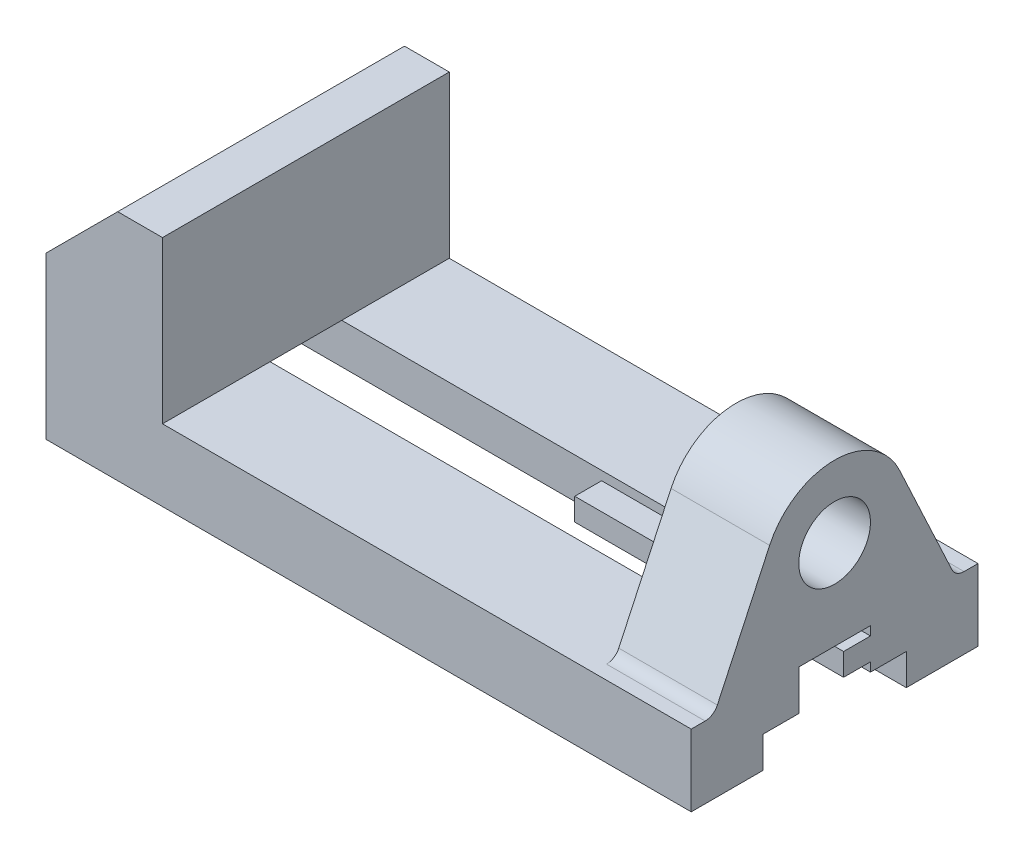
ISO-10303-21;
HEADER;
FILE_DESCRIPTION(('STEP AP214'),'2;1');
FILE_NAME('part.step','',(''),(''),'','','');
FILE_SCHEMA(('AUTOMOTIVE_DESIGN { 1 0 10303 214 1 1 1 1 }'));
ENDSEC;
DATA;
#1=APPLICATION_CONTEXT('core data for automotive mechanical design processes');
#2=APPLICATION_PROTOCOL_DEFINITION('international standard','automotive_design',2000,#1);
#3=PRODUCT_CONTEXT('',#1,'mechanical');
#4=PRODUCT('Part','Part','',(#3));
#5=PRODUCT_RELATED_PRODUCT_CATEGORY('part','',(#4));
#6=PRODUCT_DEFINITION_FORMATION('','',#4);
#7=PRODUCT_DEFINITION_CONTEXT('part definition',#1,'design');
#8=PRODUCT_DEFINITION('design','',#6,#7);
#9=PRODUCT_DEFINITION_SHAPE('','',#8);
#10=(LENGTH_UNIT() NAMED_UNIT(*) SI_UNIT(.MILLI.,.METRE.));
#11=(NAMED_UNIT(*) PLANE_ANGLE_UNIT() SI_UNIT($,.RADIAN.));
#12=(NAMED_UNIT(*) SI_UNIT($,.STERADIAN.) SOLID_ANGLE_UNIT());
#13=UNCERTAINTY_MEASURE_WITH_UNIT(LENGTH_MEASURE(1.E-05),#10,'distance_accuracy_value','');
#14=(GEOMETRIC_REPRESENTATION_CONTEXT(3) GLOBAL_UNCERTAINTY_ASSIGNED_CONTEXT((#13)) GLOBAL_UNIT_ASSIGNED_CONTEXT((#10,
#11,#12)) REPRESENTATION_CONTEXT('',''));
#15=CARTESIAN_POINT('',(0.,0.,0.));
#16=DIRECTION('',(0.,0.,1.));
#17=DIRECTION('',(1.,0.,0.));
#18=AXIS2_PLACEMENT_3D('',#15,#16,#17);
#19=CARTESIAN_POINT('',(0.,0.,32.));
#20=DIRECTION('',(0.,1.,0.));
#21=DIRECTION('',(0.,0.,1.));
#22=AXIS2_PLACEMENT_3D('',#19,#20,#21);
#23=PLANE('',#22);
#24=CARTESIAN_POINT('',(36.,0.,22.));
#25=DIRECTION('',(0.,-1.,0.));
#26=DIRECTION('',(0.,0.,-1.));
#27=AXIS2_PLACEMENT_3D('',#24,#25,#26);
#28=CIRCLE('',#27,3.);
#29=CARTESIAN_POINT('',(36.,0.,19.));
#30=VERTEX_POINT('',#29);
#31=EDGE_CURVE('E270',#30,#30,#28,.T.);
#32=ORIENTED_EDGE('',*,*,#31,.F.);
#33=EDGE_LOOP('',(#32));
#34=FACE_BOUND('',#33,.T.);
#35=CARTESIAN_POINT('',(106.,0.,22.));
#36=DIRECTION('',(0.,-1.,0.));
#37=DIRECTION('',(0.,0.,-1.));
#38=AXIS2_PLACEMENT_3D('',#35,#36,#37);
#39=CIRCLE('',#38,3.);
#40=CARTESIAN_POINT('',(106.,0.,19.));
#41=VERTEX_POINT('',#40);
#42=EDGE_CURVE('E276',#41,#41,#39,.T.);
#43=ORIENTED_EDGE('',*,*,#42,.F.);
#44=EDGE_LOOP('',(#43));
#45=FACE_BOUND('',#44,.T.);
#46=DIRECTION('',(0.,0.,-1.));
#47=VECTOR('',#46,1.);
#48=CARTESIAN_POINT('',(0.,0.,32.));
#49=LINE('',#48,#47);
#50=CARTESIAN_POINT('',(0.,0.,32.));
#51=VERTEX_POINT('',#50);
#52=CARTESIAN_POINT('',(0.,0.,16.));
#53=VERTEX_POINT('',#52);
#54=EDGE_CURVE('E434',#51,#53,#49,.T.);
#55=ORIENTED_EDGE('',*,*,#54,.T.);
#56=DIRECTION('',(1.,0.,0.));
#57=VECTOR('',#56,1.);
#58=CARTESIAN_POINT('',(0.,0.,16.));
#59=LINE('',#58,#57);
#60=CARTESIAN_POINT('',(144.,0.,16.));
#61=VERTEX_POINT('',#60);
#62=EDGE_CURVE('E324',#53,#61,#59,.T.);
#63=ORIENTED_EDGE('',*,*,#62,.T.);
#64=DIRECTION('',(0.,0.,-1.));
#65=VECTOR('',#64,1.);
#66=CARTESIAN_POINT('',(144.,0.,32.));
#67=LINE('',#66,#65);
#68=CARTESIAN_POINT('',(144.,0.,32.));
#69=VERTEX_POINT('',#68);
#70=EDGE_CURVE('E430',#69,#61,#67,.T.);
#71=ORIENTED_EDGE('',*,*,#70,.F.);
#72=DIRECTION('',(1.,0.,0.));
#73=VECTOR('',#72,1.);
#74=CARTESIAN_POINT('',(0.,0.,32.));
#75=LINE('',#74,#73);
#76=EDGE_CURVE('E388',#51,#69,#75,.T.);
#77=ORIENTED_EDGE('',*,*,#76,.F.);
#78=EDGE_LOOP('',(#55,#63,#71,#77));
#79=FACE_BOUND('',#78,.T.);
#80=ADVANCED_FACE('F34',(#34,#45,#79),#23,.F.);
#81=CARTESIAN_POINT('',(144.,16.,32.));
#82=DIRECTION('',(0.,-1.,0.));
#83=DIRECTION('',(1.,0.,0.));
#84=AXIS2_PLACEMENT_3D('',#81,#82,#83);
#85=PLANE('',#84);
#86=DIRECTION('',(0.,0.,-1.));
#87=VECTOR('',#86,1.);
#88=CARTESIAN_POINT('',(122.,16.,26.9801998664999));
#89=LINE('',#88,#87);
#90=CARTESIAN_POINT('',(122.,16.,28.8914106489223));
#91=VERTEX_POINT('',#90);
#92=CARTESIAN_POINT('',(122.,16.,8.));
#93=VERTEX_POINT('',#92);
#94=EDGE_CURVE('E356',#91,#93,#89,.T.);
#95=ORIENTED_EDGE('',*,*,#94,.T.);
#96=DIRECTION('',(1.,0.,0.));
#97=VECTOR('',#96,1.);
#98=CARTESIAN_POINT('',(0.,16.,8.));
#99=LINE('',#98,#97);
#100=CARTESIAN_POINT('',(26.,16.,8.));
#101=VERTEX_POINT('',#100);
#102=EDGE_CURVE('E335',#101,#93,#99,.T.);
#103=ORIENTED_EDGE('',*,*,#102,.F.);
#104=DIRECTION('',(0.,0.,-1.));
#105=VECTOR('',#104,1.);
#106=CARTESIAN_POINT('',(26.,16.,32.));
#107=LINE('',#106,#105);
#108=CARTESIAN_POINT('',(26.,16.,32.));
#109=VERTEX_POINT('',#108);
#110=EDGE_CURVE('E422',#109,#101,#107,.T.);
#111=ORIENTED_EDGE('',*,*,#110,.F.);
#112=DIRECTION('',(-1.,0.,0.));
#113=VECTOR('',#112,1.);
#114=CARTESIAN_POINT('',(144.,16.,32.));
#115=LINE('',#114,#113);
#116=CARTESIAN_POINT('',(144.,16.,32.));
#117=VERTEX_POINT('',#116);
#118=EDGE_CURVE('E392',#117,#109,#115,.T.);
#119=ORIENTED_EDGE('',*,*,#118,.F.);
#120=DIRECTION('',(0.,0.,-1.));
#121=VECTOR('',#120,1.);
#122=CARTESIAN_POINT('',(144.,16.,32.));
#123=LINE('',#122,#121);
#124=CARTESIAN_POINT('',(144.,16.,28.8914106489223));
#125=VERTEX_POINT('',#124);
#126=EDGE_CURVE('E426',#117,#125,#123,.T.);
#127=ORIENTED_EDGE('',*,*,#126,.T.);
#128=DIRECTION('',(1.,0.,0.));
#129=VECTOR('',#128,1.);
#130=CARTESIAN_POINT('',(144.,16.,28.8914106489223));
#131=LINE('',#130,#129);
#132=EDGE_CURVE('E440',#125,#91,#131,.F.);
#133=ORIENTED_EDGE('',*,*,#132,.T.);
#134=EDGE_LOOP('',(#95,#103,#111,#119,#127,#133));
#135=FACE_BOUND('',#134,.T.);
#136=ADVANCED_FACE('F466',(#135),#85,.F.);
#137=CARTESIAN_POINT('',(16.,52.,32.));
#138=DIRECTION('',(0.707106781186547,-0.707106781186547,0.));
#139=DIRECTION('',(0.707106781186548,0.707106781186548,0.));
#140=AXIS2_PLACEMENT_3D('',#137,#138,#139);
#141=PLANE('',#140);
#142=DIRECTION('',(-0.707106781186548,-0.707106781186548,0.));
#143=VECTOR('',#142,1.);
#144=CARTESIAN_POINT('',(16.,52.,-32.));
#145=LINE('',#144,#143);
#146=CARTESIAN_POINT('',(16.,52.,-32.));
#147=VERTEX_POINT('',#146);
#148=CARTESIAN_POINT('',(0.,36.,-32.));
#149=VERTEX_POINT('',#148);
#150=EDGE_CURVE('E379',#147,#149,#145,.T.);
#151=ORIENTED_EDGE('',*,*,#150,.T.);
#152=DIRECTION('',(0.,0.,-1.));
#153=VECTOR('',#152,1.);
#154=CARTESIAN_POINT('',(0.,36.,32.));
#155=LINE('',#154,#153);
#156=CARTESIAN_POINT('',(0.,36.,32.));
#157=VERTEX_POINT('',#156);
#158=EDGE_CURVE('E437',#157,#149,#155,.T.);
#159=ORIENTED_EDGE('',*,*,#158,.F.);
#160=DIRECTION('',(-0.707106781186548,-0.707106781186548,0.));
#161=VECTOR('',#160,1.);
#162=CARTESIAN_POINT('',(16.,52.,32.));
#163=LINE('',#162,#161);
#164=CARTESIAN_POINT('',(16.,52.,32.));
#165=VERTEX_POINT('',#164);
#166=EDGE_CURVE('E382',#165,#157,#163,.T.);
#167=ORIENTED_EDGE('',*,*,#166,.F.);
#168=DIRECTION('',(0.,0.,-1.));
#169=VECTOR('',#168,1.);
#170=CARTESIAN_POINT('',(16.,52.,32.));
#171=LINE('',#170,#169);
#172=EDGE_CURVE('E398',#165,#147,#171,.T.);
#173=ORIENTED_EDGE('',*,*,#172,.T.);
#174=EDGE_LOOP('',(#151,#159,#167,#173));
#175=FACE_BOUND('',#174,.T.);
#176=ADVANCED_FACE('F552',(#175),#141,.F.);
#177=CARTESIAN_POINT('',(0.,36.,32.));
#178=DIRECTION('',(1.,0.,0.));
#179=DIRECTION('',(0.,1.,0.));
#180=AXIS2_PLACEMENT_3D('',#177,#178,#179);
#181=PLANE('',#180);
#182=DIRECTION('',(0.,0.,1.));
#183=VECTOR('',#182,1.);
#184=CARTESIAN_POINT('',(0.,7.,16.));
#185=LINE('',#184,#183);
#186=CARTESIAN_POINT('',(0.,7.,8.));
#187=VERTEX_POINT('',#186);
#188=CARTESIAN_POINT('',(0.,7.,16.));
#189=VERTEX_POINT('',#188);
#190=EDGE_CURVE('E299',#187,#189,#185,.T.);
#191=ORIENTED_EDGE('',*,*,#190,.T.);
#192=DIRECTION('',(0.,-1.,0.));
#193=VECTOR('',#192,1.);
#194=CARTESIAN_POINT('',(0.,0.,16.));
#195=LINE('',#194,#193);
#196=EDGE_CURVE('E302',#189,#53,#195,.T.);
#197=ORIENTED_EDGE('',*,*,#196,.T.);
#198=ORIENTED_EDGE('',*,*,#54,.F.);
#199=DIRECTION('',(0.,-1.,0.));
#200=VECTOR('',#199,1.);
#201=CARTESIAN_POINT('',(0.,36.,32.));
#202=LINE('',#201,#200);
#203=EDGE_CURVE('E385',#157,#51,#202,.T.);
#204=ORIENTED_EDGE('',*,*,#203,.F.);
#205=ORIENTED_EDGE('',*,*,#158,.T.);
#206=DIRECTION('',(0.,-1.,0.));
#207=VECTOR('',#206,1.);
#208=CARTESIAN_POINT('',(0.,36.,-32.));
#209=LINE('',#208,#207);
#210=CARTESIAN_POINT('',(0.,0.,-32.));
#211=VERTEX_POINT('',#210);
#212=EDGE_CURVE('E401',#149,#211,#209,.T.);
#213=ORIENTED_EDGE('',*,*,#212,.T.);
#214=CARTESIAN_POINT('',(0.,0.,-16.));
#215=VERTEX_POINT('',#214);
#216=EDGE_CURVE('E433',#215,#211,#49,.T.);
#217=ORIENTED_EDGE('',*,*,#216,.F.);
#218=DIRECTION('',(0.,1.,0.));
#219=VECTOR('',#218,1.);
#220=CARTESIAN_POINT('',(0.,7.,-16.));
#221=LINE('',#220,#219);
#222=CARTESIAN_POINT('',(0.,7.,-16.));
#223=VERTEX_POINT('',#222);
#224=EDGE_CURVE('E283',#215,#223,#221,.T.);
#225=ORIENTED_EDGE('',*,*,#224,.T.);
#226=DIRECTION('',(0.,0.,1.));
#227=VECTOR('',#226,1.);
#228=CARTESIAN_POINT('',(0.,7.,-8.));
#229=LINE('',#228,#227);
#230=CARTESIAN_POINT('',(0.,7.,-8.));
#231=VERTEX_POINT('',#230);
#232=EDGE_CURVE('E286',#223,#231,#229,.T.);
#233=ORIENTED_EDGE('',*,*,#232,.T.);
#234=DIRECTION('',(0.,1.,0.));
#235=VECTOR('',#234,1.);
#236=CARTESIAN_POINT('',(0.,16.,-8.));
#237=LINE('',#236,#235);
#238=CARTESIAN_POINT('',(0.,16.,-8.));
#239=VERTEX_POINT('',#238);
#240=EDGE_CURVE('E290',#231,#239,#237,.T.);
#241=ORIENTED_EDGE('',*,*,#240,.T.);
#242=DIRECTION('',(0.,0.,1.));
#243=VECTOR('',#242,1.);
#244=CARTESIAN_POINT('',(0.,16.,8.));
#245=LINE('',#244,#243);
#246=CARTESIAN_POINT('',(0.,16.,8.));
#247=VERTEX_POINT('',#246);
#248=EDGE_CURVE('E293',#239,#247,#245,.T.);
#249=ORIENTED_EDGE('',*,*,#248,.T.);
#250=DIRECTION('',(0.,-1.,0.));
#251=VECTOR('',#250,1.);
#252=CARTESIAN_POINT('',(0.,7.,8.));
#253=LINE('',#252,#251);
#254=EDGE_CURVE('E296',#247,#187,#253,.T.);
#255=ORIENTED_EDGE('',*,*,#254,.T.);
#256=EDGE_LOOP('',(#191,#197,#198,#204,#205,#213,#217,#225,#233,#241,#249,#255));
#257=FACE_BOUND('',#256,.T.);
#258=ADVANCED_FACE('F528',(#257),#181,.F.);
#259=CARTESIAN_POINT('',(106.,0.,-22.));
#260=DIRECTION('',(0.,-1.,0.));
#261=DIRECTION('',(0.,0.,-1.));
#262=AXIS2_PLACEMENT_3D('',#259,#260,#261);
#263=CIRCLE('',#262,3.);
#264=CARTESIAN_POINT('',(106.,0.,-25.));
#265=VERTEX_POINT('',#264);
#266=EDGE_CURVE('E255',#265,#265,#263,.T.);
#267=ORIENTED_EDGE('',*,*,#266,.F.);
#268=EDGE_LOOP('',(#267));
#269=FACE_BOUND('',#268,.T.);
#270=CARTESIAN_POINT('',(36.,0.,-22.));
#271=DIRECTION('',(0.,-1.,0.));
#272=DIRECTION('',(0.,0.,-1.));
#273=AXIS2_PLACEMENT_3D('',#270,#271,#272);
#274=CIRCLE('',#273,3.);
#275=CARTESIAN_POINT('',(36.,0.,-25.));
#276=VERTEX_POINT('',#275);
#277=EDGE_CURVE('E264',#276,#276,#274,.T.);
#278=ORIENTED_EDGE('',*,*,#277,.F.);
#279=EDGE_LOOP('',(#278));
#280=FACE_BOUND('',#279,.T.);
#281=CARTESIAN_POINT('',(144.,0.,-16.));
#282=VERTEX_POINT('',#281);
#283=CARTESIAN_POINT('',(144.,0.,-32.));
#284=VERTEX_POINT('',#283);
#285=EDGE_CURVE('E429',#282,#284,#67,.T.);
#286=ORIENTED_EDGE('',*,*,#285,.F.);
#287=DIRECTION('',(1.,0.,0.));
#288=VECTOR('',#287,1.);
#289=CARTESIAN_POINT('',(0.,0.,-16.));
#290=LINE('',#289,#288);
#291=EDGE_CURVE('E305',#215,#282,#290,.T.);
#292=ORIENTED_EDGE('',*,*,#291,.F.);
#293=ORIENTED_EDGE('',*,*,#216,.T.);
#294=DIRECTION('',(1.,0.,0.));
#295=VECTOR('',#294,1.);
#296=CARTESIAN_POINT('',(0.,0.,-32.));
#297=LINE('',#296,#295);
#298=EDGE_CURVE('E404',#211,#284,#297,.T.);
#299=ORIENTED_EDGE('',*,*,#298,.T.);
#300=EDGE_LOOP('',(#286,#292,#293,#299));
#301=FACE_BOUND('',#300,.T.);
#302=ADVANCED_FACE('F548',(#269,#280,#301),#23,.F.);
#303=CARTESIAN_POINT('',(144.,0.,32.));
#304=DIRECTION('',(-1.,0.,0.));
#305=DIRECTION('',(0.,0.,1.));
#306=AXIS2_PLACEMENT_3D('',#303,#304,#305);
#307=PLANE('',#306);
#308=ORIENTED_EDGE('',*,*,#70,.T.);
#309=DIRECTION('',(0.,-1.,0.));
#310=VECTOR('',#309,1.);
#311=CARTESIAN_POINT('',(144.,0.,16.));
#312=LINE('',#311,#310);
#313=CARTESIAN_POINT('',(144.,7.,16.));
#314=VERTEX_POINT('',#313);
#315=EDGE_CURVE('E287',#314,#61,#312,.T.);
#316=ORIENTED_EDGE('',*,*,#315,.F.);
#317=DIRECTION('',(0.,0.,1.));
#318=VECTOR('',#317,1.);
#319=CARTESIAN_POINT('',(144.,7.,16.));
#320=LINE('',#319,#318);
#321=CARTESIAN_POINT('',(144.,7.,8.));
#322=VERTEX_POINT('',#321);
#323=EDGE_CURVE('E320',#322,#314,#320,.T.);
#324=ORIENTED_EDGE('',*,*,#323,.F.);
#325=DIRECTION('',(0.,-1.,0.));
#326=VECTOR('',#325,1.);
#327=CARTESIAN_POINT('',(144.,7.,8.));
#328=LINE('',#327,#326);
#329=CARTESIAN_POINT('',(144.,16.,8.));
#330=VERTEX_POINT('',#329);
#331=EDGE_CURVE('E317',#330,#322,#328,.T.);
#332=ORIENTED_EDGE('',*,*,#331,.F.);
#333=DIRECTION('',(0.,0.,1.));
#334=VECTOR('',#333,1.);
#335=CARTESIAN_POINT('',(144.,16.,8.));
#336=LINE('',#335,#334);
#337=CARTESIAN_POINT('',(144.,16.,-8.));
#338=VERTEX_POINT('',#337);
#339=EDGE_CURVE('E314',#338,#330,#336,.T.);
#340=ORIENTED_EDGE('',*,*,#339,.F.);
#341=DIRECTION('',(0.,1.,0.));
#342=VECTOR('',#341,1.);
#343=CARTESIAN_POINT('',(144.,16.,-8.));
#344=LINE('',#343,#342);
#345=CARTESIAN_POINT('',(144.,14.,-8.));
#346=VERTEX_POINT('',#345);
#347=EDGE_CURVE('E311',#346,#338,#344,.T.);
#348=ORIENTED_EDGE('',*,*,#347,.F.);
#349=DIRECTION('',(0.,0.,1.));
#350=VECTOR('',#349,1.);
#351=CARTESIAN_POINT('',(144.,14.,-2.));
#352=LINE('',#351,#350);
#353=CARTESIAN_POINT('',(144.,14.,-2.));
#354=VERTEX_POINT('',#353);
#355=EDGE_CURVE('E244',#346,#354,#352,.T.);
#356=ORIENTED_EDGE('',*,*,#355,.T.);
#357=DIRECTION('',(0.,-1.,0.));
#358=VECTOR('',#357,1.);
#359=CARTESIAN_POINT('',(144.,14.,-2.));
#360=LINE('',#359,#358);
#361=CARTESIAN_POINT('',(144.,9.,-2.));
#362=VERTEX_POINT('',#361);
#363=EDGE_CURVE('E251',#354,#362,#360,.T.);
#364=ORIENTED_EDGE('',*,*,#363,.T.);
#365=DIRECTION('',(0.,0.,-1.));
#366=VECTOR('',#365,1.);
#367=CARTESIAN_POINT('',(144.,9.,-2.));
#368=LINE('',#367,#366);
#369=CARTESIAN_POINT('',(144.,9.,-8.));
#370=VERTEX_POINT('',#369);
#371=EDGE_CURVE('E228',#362,#370,#368,.T.);
#372=ORIENTED_EDGE('',*,*,#371,.T.);
#373=CARTESIAN_POINT('',(144.,7.,-8.));
#374=VERTEX_POINT('',#373);
#375=EDGE_CURVE('E312',#374,#370,#344,.T.);
#376=ORIENTED_EDGE('',*,*,#375,.F.);
#377=DIRECTION('',(0.,0.,1.));
#378=VECTOR('',#377,1.);
#379=CARTESIAN_POINT('',(144.,7.,-8.));
#380=LINE('',#379,#378);
#381=CARTESIAN_POINT('',(144.,7.,-16.));
#382=VERTEX_POINT('',#381);
#383=EDGE_CURVE('E308',#382,#374,#380,.T.);
#384=ORIENTED_EDGE('',*,*,#383,.F.);
#385=DIRECTION('',(0.,1.,0.));
#386=VECTOR('',#385,1.);
#387=CARTESIAN_POINT('',(144.,7.,-16.));
#388=LINE('',#387,#386);
#389=EDGE_CURVE('E282',#282,#382,#388,.T.);
#390=ORIENTED_EDGE('',*,*,#389,.F.);
#391=ORIENTED_EDGE('',*,*,#285,.T.);
#392=DIRECTION('',(0.,1.,0.));
#393=VECTOR('',#392,1.);
#394=CARTESIAN_POINT('',(144.,0.,-32.));
#395=LINE('',#394,#393);
#396=CARTESIAN_POINT('',(144.,16.,-32.));
#397=VERTEX_POINT('',#396);
#398=EDGE_CURVE('E407',#284,#397,#395,.T.);
#399=ORIENTED_EDGE('',*,*,#398,.T.);
#400=CARTESIAN_POINT('',(144.,16.,-28.8914106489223));
#401=VERTEX_POINT('',#400);
#402=EDGE_CURVE('E425',#401,#397,#123,.T.);
#403=ORIENTED_EDGE('',*,*,#402,.F.);
#404=CARTESIAN_POINT('',(144.,19.,-28.8914106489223));
#405=DIRECTION('',(-1.,0.,0.));
#406=DIRECTION('',(0.,0.,1.));
#407=AXIS2_PLACEMENT_3D('',#404,#405,#406);
#408=CIRCLE('',#407,3.);
#409=CARTESIAN_POINT('',(144.,17.7321452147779,-26.1724872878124));
#410=VERTEX_POINT('',#409);
#411=EDGE_CURVE('E451',#401,#410,#408,.T.);
#412=ORIENTED_EDGE('',*,*,#411,.T.);
#413=DIRECTION('',(0.,0.906307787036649,0.4226182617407));
#414=VECTOR('',#413,1.);
#415=CARTESIAN_POINT('',(144.,16.,-26.9801998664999));
#416=LINE('',#415,#414);
#417=CARTESIAN_POINT('',(144.,42.7618921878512,-14.5009245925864));
#418=VERTEX_POINT('',#417);
#419=EDGE_CURVE('E353',#410,#418,#416,.T.);
#420=ORIENTED_EDGE('',*,*,#419,.T.);
#421=CARTESIAN_POINT('',(144.,36.,0.));
#422=DIRECTION('',(1.,0.,0.));
#423=DIRECTION('',(0.,0.,-1.));
#424=AXIS2_PLACEMENT_3D('',#421,#422,#423);
#425=CIRCLE('',#424,16.);
#426=CARTESIAN_POINT('',(144.,42.7618921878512,14.5009245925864));
#427=VERTEX_POINT('',#426);
#428=EDGE_CURVE('E371',#418,#427,#425,.T.);
#429=ORIENTED_EDGE('',*,*,#428,.T.);
#430=DIRECTION('',(0.,-0.906307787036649,0.4226182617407));
#431=VECTOR('',#430,1.);
#432=CARTESIAN_POINT('',(144.,16.,26.9801998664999));
#433=LINE('',#432,#431);
#434=CARTESIAN_POINT('',(144.,17.7321452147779,26.1724872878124));
#435=VERTEX_POINT('',#434);
#436=EDGE_CURVE('E374',#427,#435,#433,.T.);
#437=ORIENTED_EDGE('',*,*,#436,.T.);
#438=CARTESIAN_POINT('',(144.,19.,28.8914106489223));
#439=DIRECTION('',(-1.,0.,0.));
#440=DIRECTION('',(0.,0.,1.));
#441=AXIS2_PLACEMENT_3D('',#438,#439,#440);
#442=CIRCLE('',#441,3.);
#443=EDGE_CURVE('E42',#435,#125,#442,.T.);
#444=ORIENTED_EDGE('',*,*,#443,.T.);
#445=ORIENTED_EDGE('',*,*,#126,.F.);
#446=DIRECTION('',(0.,1.,0.));
#447=VECTOR('',#446,1.);
#448=CARTESIAN_POINT('',(144.,0.,32.));
#449=LINE('',#448,#447);
#450=EDGE_CURVE('E390',#69,#117,#449,.T.);
#451=ORIENTED_EDGE('',*,*,#450,.F.);
#452=EDGE_LOOP('',(#308,#316,#324,#332,#340,#348,#356,#364,#372,#376,#384,#390,#391,#399,#403,
#412,#420,#429,#437,#444,#445,#451));
#453=FACE_BOUND('',#452,.T.);
#454=CARTESIAN_POINT('',(144.,36.,0.));
#455=DIRECTION('',(1.,0.,0.));
#456=DIRECTION('',(0.,0.,-1.));
#457=AXIS2_PLACEMENT_3D('',#454,#455,#456);
#458=CIRCLE('',#457,8.);
#459=CARTESIAN_POINT('',(144.,36.,-8.));
#460=VERTEX_POINT('',#459);
#461=EDGE_CURVE('E349',#460,#460,#458,.T.);
#462=ORIENTED_EDGE('',*,*,#461,.F.);
#463=EDGE_LOOP('',(#462));
#464=FACE_BOUND('',#463,.T.);
#465=ADVANCED_FACE('F457',(#453,#464),#307,.F.);
#466=CARTESIAN_POINT('',(26.,16.,-8.));
#467=VERTEX_POINT('',#466);
#468=CARTESIAN_POINT('',(26.,16.,-32.));
#469=VERTEX_POINT('',#468);
#470=EDGE_CURVE('E421',#467,#469,#107,.T.);
#471=ORIENTED_EDGE('',*,*,#470,.F.);
#472=DIRECTION('',(1.,0.,0.));
#473=VECTOR('',#472,1.);
#474=CARTESIAN_POINT('',(0.,16.,-8.));
#475=LINE('',#474,#473);
#476=CARTESIAN_POINT('',(122.,16.,-8.));
#477=VERTEX_POINT('',#476);
#478=EDGE_CURVE('E340',#467,#477,#475,.T.);
#479=ORIENTED_EDGE('',*,*,#478,.T.);
#480=CARTESIAN_POINT('',(122.,16.,-28.8914106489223));
#481=VERTEX_POINT('',#480);
#482=EDGE_CURVE('E361',#477,#481,#89,.T.);
#483=ORIENTED_EDGE('',*,*,#482,.T.);
#484=DIRECTION('',(1.,0.,0.));
#485=VECTOR('',#484,1.);
#486=CARTESIAN_POINT('',(144.,16.,-28.8914106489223));
#487=LINE('',#486,#485);
#488=EDGE_CURVE('E443',#481,#401,#487,.T.);
#489=ORIENTED_EDGE('',*,*,#488,.T.);
#490=ORIENTED_EDGE('',*,*,#402,.T.);
#491=DIRECTION('',(-1.,0.,0.));
#492=VECTOR('',#491,1.);
#493=CARTESIAN_POINT('',(144.,16.,-32.));
#494=LINE('',#493,#492);
#495=EDGE_CURVE('E410',#397,#469,#494,.T.);
#496=ORIENTED_EDGE('',*,*,#495,.T.);
#497=EDGE_LOOP('',(#471,#479,#483,#489,#490,#496));
#498=FACE_BOUND('',#497,.T.);
#499=ADVANCED_FACE('F491',(#498),#85,.F.);
#500=CARTESIAN_POINT('',(26.,16.,32.));
#501=DIRECTION('',(-1.,0.,0.));
#502=DIRECTION('',(0.,-1.,0.));
#503=AXIS2_PLACEMENT_3D('',#500,#501,#502);
#504=PLANE('',#503);
#505=DIRECTION('',(0.,1.,0.));
#506=VECTOR('',#505,1.);
#507=CARTESIAN_POINT('',(26.,16.,-32.));
#508=LINE('',#507,#506);
#509=CARTESIAN_POINT('',(26.,52.,-32.));
#510=VERTEX_POINT('',#509);
#511=EDGE_CURVE('E413',#469,#510,#508,.T.);
#512=ORIENTED_EDGE('',*,*,#511,.T.);
#513=DIRECTION('',(0.,0.,-1.));
#514=VECTOR('',#513,1.);
#515=CARTESIAN_POINT('',(26.,52.,32.));
#516=LINE('',#515,#514);
#517=CARTESIAN_POINT('',(26.,52.,32.));
#518=VERTEX_POINT('',#517);
#519=EDGE_CURVE('E418',#518,#510,#516,.T.);
#520=ORIENTED_EDGE('',*,*,#519,.F.);
#521=DIRECTION('',(0.,1.,0.));
#522=VECTOR('',#521,1.);
#523=CARTESIAN_POINT('',(26.,16.,32.));
#524=LINE('',#523,#522);
#525=EDGE_CURVE('E394',#109,#518,#524,.T.);
#526=ORIENTED_EDGE('',*,*,#525,.F.);
#527=ORIENTED_EDGE('',*,*,#110,.T.);
#528=DIRECTION('',(0.,0.,-1.));
#529=VECTOR('',#528,1.);
#530=CARTESIAN_POINT('',(26.,16.,32.));
#531=LINE('',#530,#529);
#532=EDGE_CURVE('E327',#101,#467,#531,.T.);
#533=ORIENTED_EDGE('',*,*,#532,.T.);
#534=ORIENTED_EDGE('',*,*,#470,.T.);
#535=EDGE_LOOP('',(#512,#520,#526,#527,#533,#534));
#536=FACE_BOUND('',#535,.T.);
#537=ADVANCED_FACE('F505',(#536),#504,.F.);
#538=CARTESIAN_POINT('',(26.,52.,32.));
#539=DIRECTION('',(0.,-1.,0.));
#540=DIRECTION('',(0.,0.,-1.));
#541=AXIS2_PLACEMENT_3D('',#538,#539,#540);
#542=PLANE('',#541);
#543=DIRECTION('',(-1.,0.,0.));
#544=VECTOR('',#543,1.);
#545=CARTESIAN_POINT('',(26.,52.,-32.));
#546=LINE('',#545,#544);
#547=EDGE_CURVE('E386',#510,#147,#546,.T.);
#548=ORIENTED_EDGE('',*,*,#547,.T.);
#549=ORIENTED_EDGE('',*,*,#172,.F.);
#550=DIRECTION('',(-1.,0.,0.));
#551=VECTOR('',#550,1.);
#552=CARTESIAN_POINT('',(26.,52.,32.));
#553=LINE('',#552,#551);
#554=EDGE_CURVE('E396',#518,#165,#553,.T.);
#555=ORIENTED_EDGE('',*,*,#554,.F.);
#556=ORIENTED_EDGE('',*,*,#519,.T.);
#557=EDGE_LOOP('',(#548,#549,#555,#556));
#558=FACE_BOUND('',#557,.T.);
#559=ADVANCED_FACE('F577',(#558),#542,.F.);
#560=CARTESIAN_POINT('',(0.,36.,32.));
#561=DIRECTION('',(0.,0.,1.));
#562=DIRECTION('',(1.,0.,0.));
#563=AXIS2_PLACEMENT_3D('',#560,#561,#562);
#564=PLANE('',#563);
#565=ORIENTED_EDGE('',*,*,#166,.T.);
#566=ORIENTED_EDGE('',*,*,#203,.T.);
#567=ORIENTED_EDGE('',*,*,#76,.T.);
#568=ORIENTED_EDGE('',*,*,#450,.T.);
#569=ORIENTED_EDGE('',*,*,#118,.T.);
#570=ORIENTED_EDGE('',*,*,#525,.T.);
#571=ORIENTED_EDGE('',*,*,#554,.T.);
#572=EDGE_LOOP('',(#565,#566,#567,#568,#569,#570,#571));
#573=FACE_BOUND('',#572,.T.);
#574=ADVANCED_FACE('F580',(#573),#564,.T.);
#575=CARTESIAN_POINT('',(0.,36.,-32.));
#576=DIRECTION('',(0.,0.,1.));
#577=DIRECTION('',(1.,0.,0.));
#578=AXIS2_PLACEMENT_3D('',#575,#576,#577);
#579=PLANE('',#578);
#580=ORIENTED_EDGE('',*,*,#150,.F.);
#581=ORIENTED_EDGE('',*,*,#547,.F.);
#582=ORIENTED_EDGE('',*,*,#511,.F.);
#583=ORIENTED_EDGE('',*,*,#495,.F.);
#584=ORIENTED_EDGE('',*,*,#398,.F.);
#585=ORIENTED_EDGE('',*,*,#298,.F.);
#586=ORIENTED_EDGE('',*,*,#212,.F.);
#587=EDGE_LOOP('',(#580,#581,#582,#583,#584,#585,#586));
#588=FACE_BOUND('',#587,.T.);
#589=ADVANCED_FACE('F502',(#588),#579,.F.);
#590=CARTESIAN_POINT('',(122.,16.,26.9801998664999));
#591=DIRECTION('',(0.,0.4226182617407,0.90630778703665));
#592=DIRECTION('',(0.,-0.90630778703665,0.4226182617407));
#593=AXIS2_PLACEMENT_3D('',#590,#591,#592);
#594=PLANE('',#593);
#595=DIRECTION('',(0.,-0.906307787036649,0.4226182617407));
#596=VECTOR('',#595,1.);
#597=CARTESIAN_POINT('',(122.,16.,26.9801998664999));
#598=LINE('',#597,#596);
#599=CARTESIAN_POINT('',(122.,42.7618921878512,14.5009245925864));
#600=VERTEX_POINT('',#599);
#601=CARTESIAN_POINT('',(122.,17.7321452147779,26.1724872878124));
#602=VERTEX_POINT('',#601);
#603=EDGE_CURVE('E366',#600,#602,#598,.T.);
#604=ORIENTED_EDGE('',*,*,#603,.T.);
#605=DIRECTION('',(1.,0.,0.));
#606=VECTOR('',#605,1.);
#607=CARTESIAN_POINT('',(122.,17.7321452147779,26.1724872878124));
#608=LINE('',#607,#606);
#609=EDGE_CURVE('E448',#602,#435,#608,.T.);
#610=ORIENTED_EDGE('',*,*,#609,.T.);
#611=ORIENTED_EDGE('',*,*,#436,.F.);
#612=DIRECTION('',(1.,0.,0.));
#613=VECTOR('',#612,1.);
#614=CARTESIAN_POINT('',(122.,42.7618921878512,14.5009245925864));
#615=LINE('',#614,#613);
#616=EDGE_CURVE('E377',#600,#427,#615,.T.);
#617=ORIENTED_EDGE('',*,*,#616,.F.);
#618=EDGE_LOOP('',(#604,#610,#611,#617));
#619=FACE_BOUND('',#618,.T.);
#620=ADVANCED_FACE('F475',(#619),#594,.T.);
#621=CARTESIAN_POINT('',(122.,36.,0.));
#622=DIRECTION('',(1.,0.,0.));
#623=DIRECTION('',(0.,0.,-1.));
#624=AXIS2_PLACEMENT_3D('',#621,#622,#623);
#625=CYLINDRICAL_SURFACE('',#624,16.);
#626=ORIENTED_EDGE('',*,*,#428,.F.);
#627=DIRECTION('',(1.,0.,0.));
#628=VECTOR('',#627,1.);
#629=CARTESIAN_POINT('',(122.,42.7618921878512,-14.5009245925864));
#630=LINE('',#629,#628);
#631=CARTESIAN_POINT('',(122.,42.7618921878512,-14.5009245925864));
#632=VERTEX_POINT('',#631);
#633=EDGE_CURVE('E369',#632,#418,#630,.T.);
#634=ORIENTED_EDGE('',*,*,#633,.F.);
#635=CARTESIAN_POINT('',(122.,36.,0.));
#636=DIRECTION('',(1.,0.,0.));
#637=DIRECTION('',(0.,0.,-1.));
#638=AXIS2_PLACEMENT_3D('',#635,#636,#637);
#639=CIRCLE('',#638,16.);
#640=EDGE_CURVE('E363',#632,#600,#639,.T.);
#641=ORIENTED_EDGE('',*,*,#640,.T.);
#642=ORIENTED_EDGE('',*,*,#616,.T.);
#643=EDGE_LOOP('',(#626,#634,#641,#642));
#644=FACE_BOUND('',#643,.T.);
#645=ADVANCED_FACE('F479',(#644),#625,.T.);
#646=CARTESIAN_POINT('',(122.,16.,-26.9801998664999));
#647=DIRECTION('',(0.,0.4226182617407,-0.90630778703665));
#648=DIRECTION('',(0.,0.90630778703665,0.4226182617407));
#649=AXIS2_PLACEMENT_3D('',#646,#647,#648);
#650=PLANE('',#649);
#651=ORIENTED_EDGE('',*,*,#419,.F.);
#652=DIRECTION('',(1.,0.,0.));
#653=VECTOR('',#652,1.);
#654=CARTESIAN_POINT('',(122.,17.7321452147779,-26.1724872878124));
#655=LINE('',#654,#653);
#656=CARTESIAN_POINT('',(122.,17.7321452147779,-26.1724872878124));
#657=VERTEX_POINT('',#656);
#658=EDGE_CURVE('E446',#410,#657,#655,.F.);
#659=ORIENTED_EDGE('',*,*,#658,.T.);
#660=DIRECTION('',(0.,0.906307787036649,0.4226182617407));
#661=VECTOR('',#660,1.);
#662=CARTESIAN_POINT('',(122.,16.,-26.9801998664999));
#663=LINE('',#662,#661);
#664=EDGE_CURVE('E359',#657,#632,#663,.T.);
#665=ORIENTED_EDGE('',*,*,#664,.T.);
#666=ORIENTED_EDGE('',*,*,#633,.T.);
#667=EDGE_LOOP('',(#651,#659,#665,#666));
#668=FACE_BOUND('',#667,.T.);
#669=ADVANCED_FACE('F617',(#668),#650,.T.);
#670=CARTESIAN_POINT('',(122.,36.,0.));
#671=DIRECTION('',(1.,0.,0.));
#672=DIRECTION('',(0.,0.,-1.));
#673=AXIS2_PLACEMENT_3D('',#670,#671,#672);
#674=PLANE('',#673);
#675=CARTESIAN_POINT('',(122.,36.,0.));
#676=DIRECTION('',(1.,0.,0.));
#677=DIRECTION('',(0.,0.,-1.));
#678=AXIS2_PLACEMENT_3D('',#675,#676,#677);
#679=CIRCLE('',#678,8.);
#680=CARTESIAN_POINT('',(122.,36.,-8.));
#681=VERTEX_POINT('',#680);
#682=EDGE_CURVE('E350',#681,#681,#679,.T.);
#683=ORIENTED_EDGE('',*,*,#682,.T.);
#684=EDGE_LOOP('',(#683));
#685=FACE_BOUND('',#684,.T.);
#686=ORIENTED_EDGE('',*,*,#94,.F.);
#687=CARTESIAN_POINT('',(122.,19.,28.8914106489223));
#688=DIRECTION('',(1.,0.,0.));
#689=DIRECTION('',(0.,0.,-1.));
#690=AXIS2_PLACEMENT_3D('',#687,#688,#689);
#691=CIRCLE('',#690,3.);
#692=EDGE_CURVE('E11',#91,#602,#691,.T.);
#693=ORIENTED_EDGE('',*,*,#692,.T.);
#694=ORIENTED_EDGE('',*,*,#603,.F.);
#695=ORIENTED_EDGE('',*,*,#640,.F.);
#696=ORIENTED_EDGE('',*,*,#664,.F.);
#697=CARTESIAN_POINT('',(122.,19.,-28.8914106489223));
#698=DIRECTION('',(1.,0.,0.));
#699=DIRECTION('',(0.,0.,-1.));
#700=AXIS2_PLACEMENT_3D('',#697,#698,#699);
#701=CIRCLE('',#700,3.);
#702=EDGE_CURVE('E453',#657,#481,#701,.T.);
#703=ORIENTED_EDGE('',*,*,#702,.T.);
#704=ORIENTED_EDGE('',*,*,#482,.F.);
#705=EDGE_CURVE('E360',#93,#477,#89,.T.);
#706=ORIENTED_EDGE('',*,*,#705,.F.);
#707=EDGE_LOOP('',(#686,#693,#694,#695,#696,#703,#704,#706));
#708=FACE_BOUND('',#707,.T.);
#709=ADVANCED_FACE('F471',(#685,#708),#674,.F.);
#710=CARTESIAN_POINT('',(122.,36.,0.));
#711=DIRECTION('',(1.,0.,0.));
#712=DIRECTION('',(0.,0.,-1.));
#713=AXIS2_PLACEMENT_3D('',#710,#711,#712);
#714=CYLINDRICAL_SURFACE('',#713,8.);
#715=ORIENTED_EDGE('',*,*,#682,.F.);
#716=EDGE_LOOP('',(#715));
#717=FACE_BOUND('',#716,.T.);
#718=ORIENTED_EDGE('',*,*,#461,.T.);
#719=EDGE_LOOP('',(#718));
#720=FACE_BOUND('',#719,.T.);
#721=ADVANCED_FACE('F611',(#717,#720),#714,.F.);
#722=CARTESIAN_POINT('',(144.,19.,-28.8914106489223));
#723=DIRECTION('',(1.,0.,0.));
#724=DIRECTION('',(0.,1.,0.));
#725=AXIS2_PLACEMENT_3D('',#722,#723,#724);
#726=CYLINDRICAL_SURFACE('',#725,3.);
#727=ORIENTED_EDGE('',*,*,#702,.F.);
#728=ORIENTED_EDGE('',*,*,#658,.F.);
#729=ORIENTED_EDGE('',*,*,#411,.F.);
#730=ORIENTED_EDGE('',*,*,#488,.F.);
#731=EDGE_LOOP('',(#727,#728,#729,#730));
#732=FACE_BOUND('',#731,.T.);
#733=ADVANCED_FACE('F487',(#732),#726,.F.);
#734=CARTESIAN_POINT('',(122.,19.,28.8914106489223));
#735=DIRECTION('',(1.,0.,0.));
#736=DIRECTION('',(0.,1.,0.));
#737=AXIS2_PLACEMENT_3D('',#734,#735,#736);
#738=CYLINDRICAL_SURFACE('',#737,3.);
#739=ORIENTED_EDGE('',*,*,#692,.F.);
#740=ORIENTED_EDGE('',*,*,#132,.F.);
#741=ORIENTED_EDGE('',*,*,#443,.F.);
#742=ORIENTED_EDGE('',*,*,#609,.F.);
#743=EDGE_LOOP('',(#739,#740,#741,#742));
#744=FACE_BOUND('',#743,.T.);
#745=ADVANCED_FACE('F36',(#744),#738,.F.);
#746=CARTESIAN_POINT('',(0.,16.,8.));
#747=DIRECTION('',(0.,1.,0.));
#748=DIRECTION('',(0.,0.,1.));
#749=AXIS2_PLACEMENT_3D('',#746,#747,#748);
#750=PLANE('',#749);
#751=EDGE_CURVE('E332',#247,#101,#99,.T.);
#752=ORIENTED_EDGE('',*,*,#751,.F.);
#753=ORIENTED_EDGE('',*,*,#248,.F.);
#754=EDGE_CURVE('E337',#239,#467,#475,.T.);
#755=ORIENTED_EDGE('',*,*,#754,.T.);
#756=ORIENTED_EDGE('',*,*,#532,.F.);
#757=EDGE_LOOP('',(#752,#753,#755,#756));
#758=FACE_BOUND('',#757,.T.);
#759=ADVANCED_FACE('F508',(#758),#750,.F.);
#760=EDGE_CURVE('E341',#477,#338,#475,.T.);
#761=ORIENTED_EDGE('',*,*,#760,.T.);
#762=ORIENTED_EDGE('',*,*,#339,.T.);
#763=EDGE_CURVE('E336',#93,#330,#99,.T.);
#764=ORIENTED_EDGE('',*,*,#763,.F.);
#765=ORIENTED_EDGE('',*,*,#705,.T.);
#766=EDGE_LOOP('',(#761,#762,#764,#765));
#767=FACE_BOUND('',#766,.T.);
#768=ADVANCED_FACE('F520',(#767),#750,.F.);
#769=CARTESIAN_POINT('',(0.,0.,16.));
#770=DIRECTION('',(0.,0.,1.));
#771=DIRECTION('',(1.,0.,0.));
#772=AXIS2_PLACEMENT_3D('',#769,#770,#771);
#773=PLANE('',#772);
#774=ORIENTED_EDGE('',*,*,#315,.T.);
#775=ORIENTED_EDGE('',*,*,#62,.F.);
#776=ORIENTED_EDGE('',*,*,#196,.F.);
#777=DIRECTION('',(1.,0.,0.));
#778=VECTOR('',#777,1.);
#779=CARTESIAN_POINT('',(0.,7.,16.));
#780=LINE('',#779,#778);
#781=EDGE_CURVE('E328',#189,#314,#780,.T.);
#782=ORIENTED_EDGE('',*,*,#781,.T.);
#783=EDGE_LOOP('',(#774,#775,#776,#782));
#784=FACE_BOUND('',#783,.T.);
#785=ADVANCED_FACE('F585',(#784),#773,.F.);
#786=CARTESIAN_POINT('',(0.,7.,16.));
#787=DIRECTION('',(0.,1.,0.));
#788=DIRECTION('',(0.,0.,1.));
#789=AXIS2_PLACEMENT_3D('',#786,#787,#788);
#790=PLANE('',#789);
#791=ORIENTED_EDGE('',*,*,#323,.T.);
#792=ORIENTED_EDGE('',*,*,#781,.F.);
#793=ORIENTED_EDGE('',*,*,#190,.F.);
#794=DIRECTION('',(1.,0.,0.));
#795=VECTOR('',#794,1.);
#796=CARTESIAN_POINT('',(0.,7.,8.));
#797=LINE('',#796,#795);
#798=EDGE_CURVE('E330',#187,#322,#797,.T.);
#799=ORIENTED_EDGE('',*,*,#798,.T.);
#800=EDGE_LOOP('',(#791,#792,#793,#799));
#801=FACE_BOUND('',#800,.T.);
#802=ADVANCED_FACE('F524',(#801),#790,.F.);
#803=CARTESIAN_POINT('',(0.,7.,8.));
#804=DIRECTION('',(0.,0.,1.));
#805=DIRECTION('',(0.,-1.,0.));
#806=AXIS2_PLACEMENT_3D('',#803,#804,#805);
#807=PLANE('',#806);
#808=ORIENTED_EDGE('',*,*,#331,.T.);
#809=ORIENTED_EDGE('',*,*,#798,.F.);
#810=ORIENTED_EDGE('',*,*,#254,.F.);
#811=ORIENTED_EDGE('',*,*,#751,.T.);
#812=ORIENTED_EDGE('',*,*,#102,.T.);
#813=ORIENTED_EDGE('',*,*,#763,.T.);
#814=EDGE_LOOP('',(#808,#809,#810,#811,#812,#813));
#815=FACE_BOUND('',#814,.T.);
#816=ADVANCED_FACE('F513',(#815),#807,.F.);
#817=CARTESIAN_POINT('',(0.,16.,-8.));
#818=DIRECTION('',(0.,0.,-1.));
#819=DIRECTION('',(0.,1.,0.));
#820=AXIS2_PLACEMENT_3D('',#817,#818,#819);
#821=PLANE('',#820);
#822=DIRECTION('',(0.,1.,0.));
#823=VECTOR('',#822,1.);
#824=CARTESIAN_POINT('',(84.,14.,-8.));
#825=LINE('',#824,#823);
#826=CARTESIAN_POINT('',(84.,9.,-8.));
#827=VERTEX_POINT('',#826);
#828=CARTESIAN_POINT('',(84.,14.,-8.));
#829=VERTEX_POINT('',#828);
#830=EDGE_CURVE('E53',#827,#829,#825,.T.);
#831=ORIENTED_EDGE('',*,*,#830,.T.);
#832=DIRECTION('',(1.,0.,0.));
#833=VECTOR('',#832,1.);
#834=CARTESIAN_POINT('',(84.,14.,-8.));
#835=LINE('',#834,#833);
#836=EDGE_CURVE('E256',#829,#346,#835,.T.);
#837=ORIENTED_EDGE('',*,*,#836,.T.);
#838=ORIENTED_EDGE('',*,*,#347,.T.);
#839=ORIENTED_EDGE('',*,*,#760,.F.);
#840=ORIENTED_EDGE('',*,*,#478,.F.);
#841=ORIENTED_EDGE('',*,*,#754,.F.);
#842=ORIENTED_EDGE('',*,*,#240,.F.);
#843=DIRECTION('',(1.,0.,0.));
#844=VECTOR('',#843,1.);
#845=CARTESIAN_POINT('',(0.,7.,-8.));
#846=LINE('',#845,#844);
#847=EDGE_CURVE('E342',#231,#374,#846,.T.);
#848=ORIENTED_EDGE('',*,*,#847,.T.);
#849=ORIENTED_EDGE('',*,*,#375,.T.);
#850=DIRECTION('',(1.,0.,0.));
#851=VECTOR('',#850,1.);
#852=CARTESIAN_POINT('',(84.,9.,-8.));
#853=LINE('',#852,#851);
#854=EDGE_CURVE('E49',#827,#370,#853,.T.);
#855=ORIENTED_EDGE('',*,*,#854,.F.);
#856=EDGE_LOOP('',(#831,#837,#838,#839,#840,#841,#842,#848,#849,#855));
#857=FACE_BOUND('',#856,.T.);
#858=ADVANCED_FACE('F531',(#857),#821,.F.);
#859=CARTESIAN_POINT('',(0.,7.,-8.));
#860=DIRECTION('',(0.,1.,0.));
#861=DIRECTION('',(0.,0.,1.));
#862=AXIS2_PLACEMENT_3D('',#859,#860,#861);
#863=PLANE('',#862);
#864=ORIENTED_EDGE('',*,*,#383,.T.);
#865=ORIENTED_EDGE('',*,*,#847,.F.);
#866=ORIENTED_EDGE('',*,*,#232,.F.);
#867=DIRECTION('',(1.,0.,0.));
#868=VECTOR('',#867,1.);
#869=CARTESIAN_POINT('',(0.,7.,-16.));
#870=LINE('',#869,#868);
#871=EDGE_CURVE('E344',#223,#382,#870,.T.);
#872=ORIENTED_EDGE('',*,*,#871,.T.);
#873=EDGE_LOOP('',(#864,#865,#866,#872));
#874=FACE_BOUND('',#873,.T.);
#875=ADVANCED_FACE('F603',(#874),#863,.F.);
#876=CARTESIAN_POINT('',(0.,7.,-16.));
#877=DIRECTION('',(0.,0.,-1.));
#878=DIRECTION('',(-1.,0.,0.));
#879=AXIS2_PLACEMENT_3D('',#876,#877,#878);
#880=PLANE('',#879);
#881=ORIENTED_EDGE('',*,*,#389,.T.);
#882=ORIENTED_EDGE('',*,*,#871,.F.);
#883=ORIENTED_EDGE('',*,*,#224,.F.);
#884=ORIENTED_EDGE('',*,*,#291,.T.);
#885=EDGE_LOOP('',(#881,#882,#883,#884));
#886=FACE_BOUND('',#885,.T.);
#887=ADVANCED_FACE('F606',(#886),#880,.F.);
#888=CARTESIAN_POINT('',(106.,10.,22.));
#889=DIRECTION('',(0.,-1.,0.));
#890=DIRECTION('',(0.,0.,-1.));
#891=AXIS2_PLACEMENT_3D('',#888,#889,#890);
#892=CONICAL_SURFACE('',#891,3.,1.02974425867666);
#893=CARTESIAN_POINT('',(106.,11.8025818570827,22.));
#894=VERTEX_POINT('',#893);
#895=VERTEX_LOOP('',#894);
#896=FACE_BOUND('',#895,.T.);
#897=CARTESIAN_POINT('',(106.,10.,22.));
#898=DIRECTION('',(0.,-1.,0.));
#899=DIRECTION('',(0.,0.,-1.));
#900=AXIS2_PLACEMENT_3D('',#897,#898,#899);
#901=CIRCLE('',#900,3.);
#902=CARTESIAN_POINT('',(106.,10.,19.));
#903=VERTEX_POINT('',#902);
#904=EDGE_CURVE('E279',#903,#903,#901,.T.);
#905=ORIENTED_EDGE('',*,*,#904,.T.);
#906=EDGE_LOOP('',(#905));
#907=FACE_BOUND('',#906,.T.);
#908=ADVANCED_FACE('F595',(#896,#907),#892,.F.);
#909=CARTESIAN_POINT('',(106.,0.,22.));
#910=DIRECTION('',(0.,-1.,0.));
#911=DIRECTION('',(0.,0.,-1.));
#912=AXIS2_PLACEMENT_3D('',#909,#910,#911);
#913=CYLINDRICAL_SURFACE('',#912,3.);
#914=ORIENTED_EDGE('',*,*,#904,.F.);
#915=EDGE_LOOP('',(#914));
#916=FACE_BOUND('',#915,.T.);
#917=ORIENTED_EDGE('',*,*,#42,.T.);
#918=EDGE_LOOP('',(#917));
#919=FACE_BOUND('',#918,.T.);
#920=ADVANCED_FACE('F743',(#916,#919),#913,.F.);
#921=CARTESIAN_POINT('',(36.,10.,22.));
#922=DIRECTION('',(0.,-1.,0.));
#923=DIRECTION('',(0.,0.,-1.));
#924=AXIS2_PLACEMENT_3D('',#921,#922,#923);
#925=CONICAL_SURFACE('',#924,3.,1.02974425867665);
#926=CARTESIAN_POINT('',(36.,11.8025818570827,22.));
#927=VERTEX_POINT('',#926);
#928=VERTEX_LOOP('',#927);
#929=FACE_BOUND('',#928,.T.);
#930=CARTESIAN_POINT('',(36.,10.,22.));
#931=DIRECTION('',(0.,-1.,0.));
#932=DIRECTION('',(0.,0.,-1.));
#933=AXIS2_PLACEMENT_3D('',#930,#931,#932);
#934=CIRCLE('',#933,3.);
#935=CARTESIAN_POINT('',(36.,10.,19.));
#936=VERTEX_POINT('',#935);
#937=EDGE_CURVE('E273',#936,#936,#934,.T.);
#938=ORIENTED_EDGE('',*,*,#937,.T.);
#939=EDGE_LOOP('',(#938));
#940=FACE_BOUND('',#939,.T.);
#941=ADVANCED_FACE('F753',(#929,#940),#925,.F.);
#942=CARTESIAN_POINT('',(36.,0.,22.));
#943=DIRECTION('',(0.,-1.,0.));
#944=DIRECTION('',(0.,0.,-1.));
#945=AXIS2_PLACEMENT_3D('',#942,#943,#944);
#946=CYLINDRICAL_SURFACE('',#945,3.);
#947=ORIENTED_EDGE('',*,*,#937,.F.);
#948=EDGE_LOOP('',(#947));
#949=FACE_BOUND('',#948,.T.);
#950=ORIENTED_EDGE('',*,*,#31,.T.);
#951=EDGE_LOOP('',(#950));
#952=FACE_BOUND('',#951,.T.);
#953=ADVANCED_FACE('F763',(#949,#952),#946,.F.);
#954=CARTESIAN_POINT('',(36.,10.,-22.));
#955=DIRECTION('',(0.,-1.,0.));
#956=DIRECTION('',(0.,0.,-1.));
#957=AXIS2_PLACEMENT_3D('',#954,#955,#956);
#958=CONICAL_SURFACE('',#957,3.,1.02974425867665);
#959=CARTESIAN_POINT('',(36.,11.8025818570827,-22.));
#960=VERTEX_POINT('',#959);
#961=VERTEX_LOOP('',#960);
#962=FACE_BOUND('',#961,.T.);
#963=CARTESIAN_POINT('',(36.,10.,-22.));
#964=DIRECTION('',(0.,-1.,0.));
#965=DIRECTION('',(0.,0.,-1.));
#966=AXIS2_PLACEMENT_3D('',#963,#964,#965);
#967=CIRCLE('',#966,3.);
#968=CARTESIAN_POINT('',(36.,10.,-25.));
#969=VERTEX_POINT('',#968);
#970=EDGE_CURVE('E267',#969,#969,#967,.T.);
#971=ORIENTED_EDGE('',*,*,#970,.T.);
#972=EDGE_LOOP('',(#971));
#973=FACE_BOUND('',#972,.T.);
#974=ADVANCED_FACE('F773',(#962,#973),#958,.F.);
#975=CARTESIAN_POINT('',(36.,0.,-22.));
#976=DIRECTION('',(0.,-1.,0.));
#977=DIRECTION('',(0.,0.,-1.));
#978=AXIS2_PLACEMENT_3D('',#975,#976,#977);
#979=CYLINDRICAL_SURFACE('',#978,3.);
#980=ORIENTED_EDGE('',*,*,#970,.F.);
#981=EDGE_LOOP('',(#980));
#982=FACE_BOUND('',#981,.T.);
#983=ORIENTED_EDGE('',*,*,#277,.T.);
#984=EDGE_LOOP('',(#983));
#985=FACE_BOUND('',#984,.T.);
#986=ADVANCED_FACE('F784',(#982,#985),#979,.F.);
#987=CARTESIAN_POINT('',(106.,10.,-22.));
#988=DIRECTION('',(0.,-1.,0.));
#989=DIRECTION('',(0.,0.,-1.));
#990=AXIS2_PLACEMENT_3D('',#987,#988,#989);
#991=CONICAL_SURFACE('',#990,3.,1.02974425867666);
#992=CARTESIAN_POINT('',(106.,11.8025818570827,-22.));
#993=VERTEX_POINT('',#992);
#994=VERTEX_LOOP('',#993);
#995=FACE_BOUND('',#994,.T.);
#996=CARTESIAN_POINT('',(106.,10.,-22.));
#997=DIRECTION('',(0.,-1.,0.));
#998=DIRECTION('',(0.,0.,-1.));
#999=AXIS2_PLACEMENT_3D('',#996,#997,#998);
#1000=CIRCLE('',#999,3.);
#1001=CARTESIAN_POINT('',(106.,10.,-25.));
#1002=VERTEX_POINT('',#1001);
#1003=EDGE_CURVE('E261',#1002,#1002,#1000,.T.);
#1004=ORIENTED_EDGE('',*,*,#1003,.T.);
#1005=EDGE_LOOP('',(#1004));
#1006=FACE_BOUND('',#1005,.T.);
#1007=ADVANCED_FACE('F794',(#995,#1006),#991,.F.);
#1008=CARTESIAN_POINT('',(106.,0.,-22.));
#1009=DIRECTION('',(0.,-1.,0.));
#1010=DIRECTION('',(0.,0.,-1.));
#1011=AXIS2_PLACEMENT_3D('',#1008,#1009,#1010);
#1012=CYLINDRICAL_SURFACE('',#1011,3.);
#1013=ORIENTED_EDGE('',*,*,#1003,.F.);
#1014=EDGE_LOOP('',(#1013));
#1015=FACE_BOUND('',#1014,.T.);
#1016=ORIENTED_EDGE('',*,*,#266,.T.);
#1017=EDGE_LOOP('',(#1016));
#1018=FACE_BOUND('',#1017,.T.);
#1019=ADVANCED_FACE('F542',(#1015,#1018),#1012,.F.);
#1020=CARTESIAN_POINT('',(84.,14.,-2.));
#1021=DIRECTION('',(0.,0.,1.));
#1022=DIRECTION('',(0.,-1.,0.));
#1023=AXIS2_PLACEMENT_3D('',#1020,#1021,#1022);
#1024=PLANE('',#1023);
#1025=ORIENTED_EDGE('',*,*,#363,.F.);
#1026=DIRECTION('',(1.,0.,0.));
#1027=VECTOR('',#1026,1.);
#1028=CARTESIAN_POINT('',(84.,14.,-2.));
#1029=LINE('',#1028,#1027);
#1030=CARTESIAN_POINT('',(84.,14.,-2.));
#1031=VERTEX_POINT('',#1030);
#1032=EDGE_CURVE('E243',#1031,#354,#1029,.T.);
#1033=ORIENTED_EDGE('',*,*,#1032,.F.);
#1034=DIRECTION('',(0.,-1.,0.));
#1035=VECTOR('',#1034,1.);
#1036=CARTESIAN_POINT('',(84.,14.,-2.));
#1037=LINE('',#1036,#1035);
#1038=CARTESIAN_POINT('',(84.,9.,-2.));
#1039=VERTEX_POINT('',#1038);
#1040=EDGE_CURVE('E239',#1031,#1039,#1037,.T.);
#1041=ORIENTED_EDGE('',*,*,#1040,.T.);
#1042=DIRECTION('',(1.,0.,0.));
#1043=VECTOR('',#1042,1.);
#1044=CARTESIAN_POINT('',(84.,9.,-2.));
#1045=LINE('',#1044,#1043);
#1046=EDGE_CURVE('E223',#1039,#362,#1045,.T.);
#1047=ORIENTED_EDGE('',*,*,#1046,.T.);
#1048=EDGE_LOOP('',(#1025,#1033,#1041,#1047));
#1049=FACE_BOUND('',#1048,.T.);
#1050=ADVANCED_FACE('F242',(#1049),#1024,.T.);
#1051=CARTESIAN_POINT('',(84.,14.,-2.));
#1052=DIRECTION('',(0.,1.,0.));
#1053=DIRECTION('',(0.,0.,1.));
#1054=AXIS2_PLACEMENT_3D('',#1051,#1052,#1053);
#1055=PLANE('',#1054);
#1056=ORIENTED_EDGE('',*,*,#355,.F.);
#1057=ORIENTED_EDGE('',*,*,#836,.F.);
#1058=DIRECTION('',(0.,0.,1.));
#1059=VECTOR('',#1058,1.);
#1060=CARTESIAN_POINT('',(84.,14.,-2.));
#1061=LINE('',#1060,#1059);
#1062=EDGE_CURVE('E233',#829,#1031,#1061,.T.);
#1063=ORIENTED_EDGE('',*,*,#1062,.T.);
#1064=ORIENTED_EDGE('',*,*,#1032,.T.);
#1065=EDGE_LOOP('',(#1056,#1057,#1063,#1064));
#1066=FACE_BOUND('',#1065,.T.);
#1067=ADVANCED_FACE('F534',(#1066),#1055,.T.);
#1068=CARTESIAN_POINT('',(84.,9.,-2.));
#1069=DIRECTION('',(0.,-1.,0.));
#1070=DIRECTION('',(0.,0.,-1.));
#1071=AXIS2_PLACEMENT_3D('',#1068,#1069,#1070);
#1072=PLANE('',#1071);
#1073=ORIENTED_EDGE('',*,*,#371,.F.);
#1074=ORIENTED_EDGE('',*,*,#1046,.F.);
#1075=DIRECTION('',(0.,0.,-1.));
#1076=VECTOR('',#1075,1.);
#1077=CARTESIAN_POINT('',(84.,9.,-2.));
#1078=LINE('',#1077,#1076);
#1079=EDGE_CURVE('E226',#1039,#827,#1078,.T.);
#1080=ORIENTED_EDGE('',*,*,#1079,.T.);
#1081=ORIENTED_EDGE('',*,*,#854,.T.);
#1082=EDGE_LOOP('',(#1073,#1074,#1080,#1081));
#1083=FACE_BOUND('',#1082,.T.);
#1084=ADVANCED_FACE('F225',(#1083),#1072,.T.);
#1085=CARTESIAN_POINT('',(84.,0.,0.));
#1086=DIRECTION('',(1.,0.,0.));
#1087=DIRECTION('',(0.,0.,-1.));
#1088=AXIS2_PLACEMENT_3D('',#1085,#1086,#1087);
#1089=PLANE('',#1088);
#1090=ORIENTED_EDGE('',*,*,#1040,.F.);
#1091=ORIENTED_EDGE('',*,*,#1062,.F.);
#1092=ORIENTED_EDGE('',*,*,#830,.F.);
#1093=ORIENTED_EDGE('',*,*,#1079,.F.);
#1094=EDGE_LOOP('',(#1090,#1091,#1092,#1093));
#1095=FACE_BOUND('',#1094,.T.);
#1096=ADVANCED_FACE('F237',(#1095),#1089,.F.);
#1097=CLOSED_SHELL('',(#80,#136,#176,#258,#302,#465,#499,#537,#559,#574,#589,#620,#645,#669,
#709,#721,#733,#745,#759,#768,#785,#802,#816,#858,#875,#887,#908,#920,#941,#953,#974,#986,#1007,
#1019,#1050,#1067,#1084,#1096));
#1098=MANIFOLD_SOLID_BREP('B2',#1097);
#1099=ADVANCED_BREP_SHAPE_REPRESENTATION('',(#18,#1098),#14);
#1100=SHAPE_DEFINITION_REPRESENTATION(#9,#1099);
ENDSEC;
END-ISO-10303-21;
